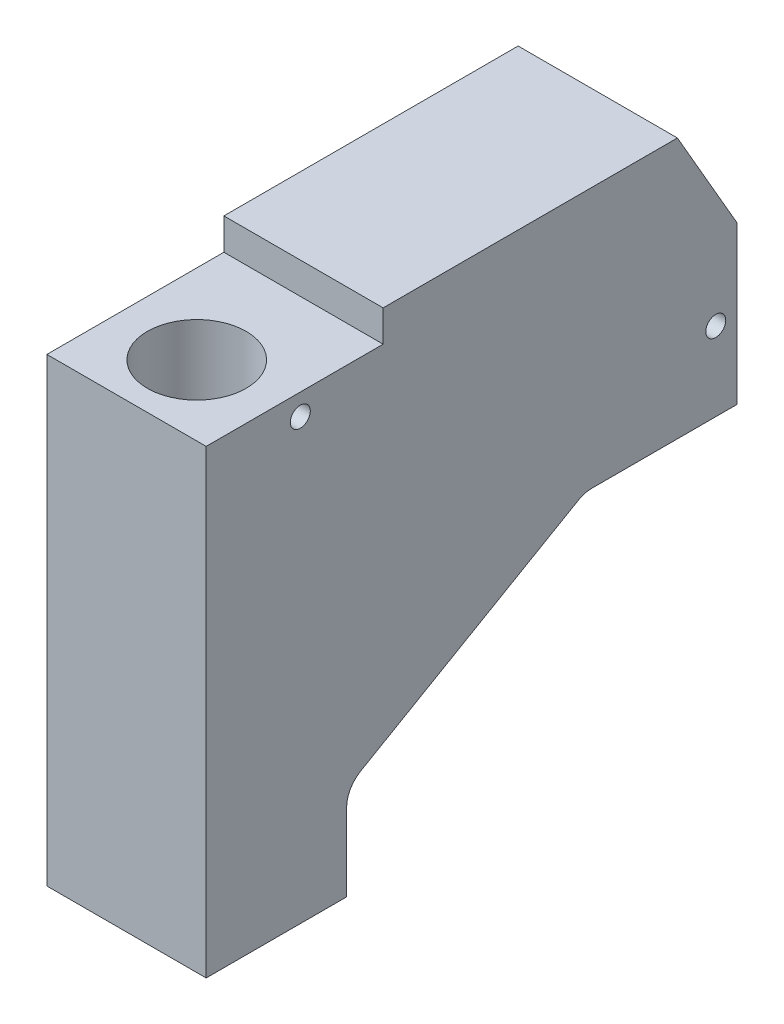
ISO-10303-21;
HEADER;
FILE_DESCRIPTION(('STEP AP214'),'2;1');
FILE_NAME('part.step','',(''),(''),'','','');
FILE_SCHEMA(('AUTOMOTIVE_DESIGN { 1 0 10303 214 1 1 1 1 }'));
ENDSEC;
DATA;
#1=APPLICATION_CONTEXT('core data for automotive mechanical design processes');
#2=APPLICATION_PROTOCOL_DEFINITION('international standard','automotive_design',2000,#1);
#3=PRODUCT_CONTEXT('',#1,'mechanical');
#4=PRODUCT('Part','Part','',(#3));
#5=PRODUCT_RELATED_PRODUCT_CATEGORY('part','',(#4));
#6=PRODUCT_DEFINITION_FORMATION('','',#4);
#7=PRODUCT_DEFINITION_CONTEXT('part definition',#1,'design');
#8=PRODUCT_DEFINITION('design','',#6,#7);
#9=PRODUCT_DEFINITION_SHAPE('','',#8);
#10=(LENGTH_UNIT() NAMED_UNIT(*) SI_UNIT(.MILLI.,.METRE.));
#11=(NAMED_UNIT(*) PLANE_ANGLE_UNIT() SI_UNIT($,.RADIAN.));
#12=(NAMED_UNIT(*) SI_UNIT($,.STERADIAN.) SOLID_ANGLE_UNIT());
#13=UNCERTAINTY_MEASURE_WITH_UNIT(LENGTH_MEASURE(1.E-05),#10,'distance_accuracy_value','');
#14=(GEOMETRIC_REPRESENTATION_CONTEXT(3) GLOBAL_UNCERTAINTY_ASSIGNED_CONTEXT((#13)) GLOBAL_UNIT_ASSIGNED_CONTEXT((#10,
#11,#12)) REPRESENTATION_CONTEXT('',''));
#15=CARTESIAN_POINT('',(0.,0.,0.));
#16=DIRECTION('',(0.,0.,1.));
#17=DIRECTION('',(1.,0.,0.));
#18=AXIS2_PLACEMENT_3D('',#15,#16,#17);
#19=CARTESIAN_POINT('',(0.,4.34443852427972,-16.));
#20=DIRECTION('',(0.,0.,1.));
#21=DIRECTION('',(0.,-1.,0.));
#22=AXIS2_PLACEMENT_3D('',#19,#20,#21);
#23=PLANE('',#22);
#24=CARTESIAN_POINT('',(0.,9.92568852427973,-16.));
#25=DIRECTION('',(0.,0.,1.));
#26=DIRECTION('',(0.,-1.,0.));
#27=AXIS2_PLACEMENT_3D('',#24,#25,#26);
#28=CIRCLE('',#27,5.58125);
#29=CARTESIAN_POINT('',(0.,4.34443852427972,-16.));
#30=VERTEX_POINT('',#29);
#31=EDGE_CURVE('E148',#30,#30,#28,.F.);
#32=ORIENTED_EDGE('',*,*,#31,.T.);
#33=EDGE_LOOP('',(#32));
#34=FACE_BOUND('',#33,.T.);
#35=CARTESIAN_POINT('',(0.,10.0221109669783,-16.));
#36=DIRECTION('',(0.,0.,1.));
#37=DIRECTION('',(0.,-1.,0.));
#38=AXIS2_PLACEMENT_3D('',#35,#36,#37);
#39=ELLIPSE('',#38,2.88675134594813,2.5);
#40=CARTESIAN_POINT('',(0.,7.13535962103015,-16.));
#41=VERTEX_POINT('',#40);
#42=EDGE_CURVE('E20',#41,#41,#39,.T.);
#43=ORIENTED_EDGE('',*,*,#42,.T.);
#44=EDGE_LOOP('',(#43));
#45=FACE_BOUND('',#44,.T.);
#46=ADVANCED_FACE('F17',(#34,#45),#23,.F.);
#47=CARTESIAN_POINT('',(0.,-13.3966593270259,22.0625));
#48=DIRECTION('',(0.,1.,0.));
#49=DIRECTION('',(0.,0.,1.));
#50=AXIS2_PLACEMENT_3D('',#47,#48,#49);
#51=CONICAL_SURFACE('',#50,2.50000000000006,1.04719755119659);
#52=CARTESIAN_POINT('',(0.,-13.3966593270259,22.0625));
#53=DIRECTION('',(0.,1.,0.));
#54=DIRECTION('',(0.,0.,1.));
#55=AXIS2_PLACEMENT_3D('',#52,#53,#54);
#56=CIRCLE('',#55,2.5);
#57=CARTESIAN_POINT('',(0.,-13.396659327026,19.5624999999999));
#58=VERTEX_POINT('',#57);
#59=EDGE_CURVE('E126',#58,#58,#56,.T.);
#60=ORIENTED_EDGE('',*,*,#59,.T.);
#61=EDGE_LOOP('',(#60));
#62=FACE_BOUND('',#61,.T.);
#63=CARTESIAN_POINT('',(0.,-14.6933880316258,22.0625));
#64=DIRECTION('',(0.,-1.,0.));
#65=DIRECTION('',(1.,0.,0.));
#66=AXIS2_PLACEMENT_3D('',#63,#64,#65);
#67=CIRCLE('',#66,0.254000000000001);
#68=CARTESIAN_POINT('',(0.254000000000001,-14.6933880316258,22.0625));
#69=VERTEX_POINT('',#68);
#70=EDGE_CURVE('E141',#69,#69,#67,.T.);
#71=ORIENTED_EDGE('',*,*,#70,.T.);
#72=EDGE_LOOP('',(#71));
#73=FACE_BOUND('',#72,.T.);
#74=ADVANCED_FACE('F128',(#62,#73),#51,.F.);
#75=CARTESIAN_POINT('',(0.,20.5273403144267,-34.1955909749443));
#76=DIRECTION('',(0.,-0.5,0.866025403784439));
#77=DIRECTION('',(0.,-0.866025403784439,-0.5));
#78=AXIS2_PLACEMENT_3D('',#75,#76,#77);
#79=CYLINDRICAL_SURFACE('',#78,2.5);
#80=CARTESIAN_POINT('',(0.,-11.9532836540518,22.0625));
#81=DIRECTION('',(0.,-0.866025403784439,0.5));
#82=DIRECTION('',(0.,0.5,0.866025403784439));
#83=AXIS2_PLACEMENT_3D('',#80,#81,#82);
#84=ELLIPSE('',#83,2.88675134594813,2.5);
#85=CARTESIAN_POINT('',(-2.5,-11.9532836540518,22.0625));
#86=VERTEX_POINT('',#85);
#87=EDGE_CURVE('E133',#86,#58,#84,.T.);
#88=ORIENTED_EDGE('',*,*,#87,.T.);
#89=CARTESIAN_POINT('',(0.,-11.9532836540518,22.0625));
#90=DIRECTION('',(0.,-0.866025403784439,0.5));
#91=DIRECTION('',(0.,0.5,0.866025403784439));
#92=AXIS2_PLACEMENT_3D('',#89,#90,#91);
#93=ELLIPSE('',#92,2.88675134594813,2.5);
#94=CARTESIAN_POINT('',(2.5,-11.9532836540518,22.0625));
#95=VERTEX_POINT('',#94);
#96=EDGE_CURVE('E137',#58,#95,#93,.T.);
#97=ORIENTED_EDGE('',*,*,#96,.T.);
#98=CARTESIAN_POINT('',(0.,-11.9532836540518,22.0625));
#99=DIRECTION('',(0.,0.5,0.866025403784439));
#100=DIRECTION('',(0.,-0.866025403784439,0.5));
#101=AXIS2_PLACEMENT_3D('',#98,#99,#100);
#102=ELLIPSE('',#101,5.,2.5);
#103=EDGE_CURVE('E132',#95,#86,#102,.T.);
#104=ORIENTED_EDGE('',*,*,#103,.T.);
#105=EDGE_LOOP('',(#88,#97,#104));
#106=FACE_BOUND('',#105,.T.);
#107=ORIENTED_EDGE('',*,*,#42,.F.);
#108=EDGE_LOOP('',(#107));
#109=FACE_BOUND('',#108,.T.);
#110=ADVANCED_FACE('F143',(#106,#109),#79,.F.);
#111=CARTESIAN_POINT('',(0.,9.92568852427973,-16.));
#112=DIRECTION('',(0.,0.,1.));
#113=DIRECTION('',(0.,-1.,0.));
#114=AXIS2_PLACEMENT_3D('',#111,#112,#113);
#115=CYLINDRICAL_SURFACE('',#114,5.58125);
#116=CARTESIAN_POINT('',(0.,9.92568852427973,-20.5000000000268));
#117=DIRECTION('',(0.,0.,-1.));
#118=DIRECTION('',(-1.,0.,0.));
#119=AXIS2_PLACEMENT_3D('',#116,#117,#118);
#120=CIRCLE('',#119,5.58125000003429);
#121=CARTESIAN_POINT('',(-5.58125000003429,9.92568852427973,-20.5000000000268));
#122=VERTEX_POINT('',#121);
#123=EDGE_CURVE('E276',#122,#122,#120,.T.);
#124=ORIENTED_EDGE('',*,*,#123,.T.);
#125=EDGE_LOOP('',(#124));
#126=FACE_BOUND('',#125,.T.);
#127=ORIENTED_EDGE('',*,*,#31,.F.);
#128=EDGE_LOOP('',(#127));
#129=FACE_BOUND('',#128,.T.);
#130=ADVANCED_FACE('F158',(#126,#129),#115,.F.);
#131=CARTESIAN_POINT('',(0.,27.792585,22.0625));
#132=DIRECTION('',(0.,-1.,0.));
#133=DIRECTION('',(1.,0.,0.));
#134=AXIS2_PLACEMENT_3D('',#131,#132,#133);
#135=CYLINDRICAL_SURFACE('',#134,0.254000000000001);
#136=ORIENTED_EDGE('',*,*,#70,.F.);
#137=EDGE_LOOP('',(#136));
#138=FACE_BOUND('',#137,.T.);
#139=CARTESIAN_POINT('',(0.,-25.791585,22.0625));
#140=DIRECTION('',(0.,-1.,0.));
#141=DIRECTION('',(1.,0.,0.));
#142=AXIS2_PLACEMENT_3D('',#139,#140,#141);
#143=CIRCLE('',#142,0.254000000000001);
#144=CARTESIAN_POINT('',(0.254000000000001,-25.791585,22.0625));
#145=VERTEX_POINT('',#144);
#146=EDGE_CURVE('E274',#145,#145,#143,.F.);
#147=ORIENTED_EDGE('',*,*,#146,.F.);
#148=EDGE_LOOP('',(#147));
#149=FACE_BOUND('',#148,.T.);
#150=ADVANCED_FACE('F165',(#138,#149),#135,.F.);
#151=CARTESIAN_POINT('',(0.,27.791585,22.0625));
#152=DIRECTION('',(0.,1.,0.));
#153=DIRECTION('',(0.,0.,1.));
#154=AXIS2_PLACEMENT_3D('',#151,#152,#153);
#155=CYLINDRICAL_SURFACE('',#154,2.5);
#156=CARTESIAN_POINT('',(0.,12.473585,22.0625));
#157=DIRECTION('',(0.,1.,0.));
#158=DIRECTION('',(0.,0.,1.));
#159=AXIS2_PLACEMENT_3D('',#156,#157,#158);
#160=CIRCLE('',#159,2.5);
#161=CARTESIAN_POINT('',(0.,12.473585,24.5625));
#162=VERTEX_POINT('',#161);
#163=EDGE_CURVE('E275',#162,#162,#160,.F.);
#164=ORIENTED_EDGE('',*,*,#163,.F.);
#165=EDGE_LOOP('',(#164));
#166=FACE_BOUND('',#165,.T.);
#167=ORIENTED_EDGE('',*,*,#103,.F.);
#168=ORIENTED_EDGE('',*,*,#96,.F.);
#169=ORIENTED_EDGE('',*,*,#59,.F.);
#170=ORIENTED_EDGE('',*,*,#87,.F.);
#171=EDGE_LOOP('',(#167,#168,#169,#170));
#172=FACE_BOUND('',#171,.T.);
#173=ADVANCED_FACE('F139',(#166,#172),#155,.F.);
#174=CARTESIAN_POINT('',(0.,9.92568852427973,-21.0087899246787));
#175=DIRECTION('',(0.,0.,-1.));
#176=DIRECTION('',(-1.,0.,0.));
#177=AXIS2_PLACEMENT_3D('',#174,#175,#176);
#178=CONICAL_SURFACE('',#177,5.87500000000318,0.523598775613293);
#179=ORIENTED_EDGE('',*,*,#123,.F.);
#180=EDGE_LOOP('',(#179));
#181=FACE_BOUND('',#180,.T.);
#182=CARTESIAN_POINT('',(0.,9.92568852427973,-21.0087899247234));
#183=DIRECTION('',(0.,0.,1.));
#184=DIRECTION('',(0.,-1.,0.));
#185=AXIS2_PLACEMENT_3D('',#182,#183,#184);
#186=CIRCLE('',#185,5.875);
#187=CARTESIAN_POINT('',(0.,15.8006885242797,-21.0087899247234));
#188=VERTEX_POINT('',#187);
#189=EDGE_CURVE('E313',#188,#188,#186,.F.);
#190=ORIENTED_EDGE('',*,*,#189,.T.);
#191=EDGE_LOOP('',(#190));
#192=FACE_BOUND('',#191,.T.);
#193=ADVANCED_FACE('F258',(#181,#192),#178,.F.);
#194=CARTESIAN_POINT('',(0.,-25.791585,22.0625));
#195=DIRECTION('',(0.,-1.,0.));
#196=DIRECTION('',(1.,0.,0.));
#197=AXIS2_PLACEMENT_3D('',#194,#195,#196);
#198=PLANE('',#197);
#199=ORIENTED_EDGE('',*,*,#146,.T.);
#200=EDGE_LOOP('',(#199));
#201=FACE_BOUND('',#200,.T.);
#202=CARTESIAN_POINT('',(0.,-25.791585,22.0625));
#203=DIRECTION('',(0.,-1.,0.));
#204=DIRECTION('',(1.,0.,0.));
#205=AXIS2_PLACEMENT_3D('',#202,#203,#204);
#206=CIRCLE('',#205,4.);
#207=CARTESIAN_POINT('',(4.,-25.791585,22.0625));
#208=VERTEX_POINT('',#207);
#209=EDGE_CURVE('E314',#208,#208,#206,.T.);
#210=ORIENTED_EDGE('',*,*,#209,.T.);
#211=EDGE_LOOP('',(#210));
#212=FACE_BOUND('',#211,.T.);
#213=ADVANCED_FACE('F254',(#201,#212),#198,.T.);
#214=CARTESIAN_POINT('',(0.,12.473585,22.0625));
#215=DIRECTION('',(0.,1.,0.));
#216=DIRECTION('',(-1.,0.,0.));
#217=AXIS2_PLACEMENT_3D('',#214,#215,#216);
#218=PLANE('',#217);
#219=CARTESIAN_POINT('',(0.,12.473585,22.0625));
#220=DIRECTION('',(0.,1.,0.));
#221=DIRECTION('',(-1.,0.,0.));
#222=AXIS2_PLACEMENT_3D('',#219,#220,#221);
#223=CIRCLE('',#222,5.58125);
#224=CARTESIAN_POINT('',(-5.58125,12.473585,22.0625));
#225=VERTEX_POINT('',#224);
#226=EDGE_CURVE('E239',#225,#225,#223,.T.);
#227=ORIENTED_EDGE('',*,*,#226,.T.);
#228=EDGE_LOOP('',(#227));
#229=FACE_BOUND('',#228,.T.);
#230=ORIENTED_EDGE('',*,*,#163,.T.);
#231=EDGE_LOOP('',(#230));
#232=FACE_BOUND('',#231,.T.);
#233=ADVANCED_FACE('F248',(#229,#232),#218,.T.);
#234=CARTESIAN_POINT('',(9.,21.822585,19.3625));
#235=DIRECTION('',(1.,0.,0.));
#236=DIRECTION('',(0.,1.,0.));
#237=AXIS2_PLACEMENT_3D('',#234,#235,#236);
#238=CYLINDRICAL_SURFACE('',#237,1.1303);
#239=CARTESIAN_POINT('',(5.35596802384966,21.8225850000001,20.4928));
#240=CARTESIAN_POINT('',(5.35596781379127,21.8837119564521,20.4927941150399));
#241=CARTESIAN_POINT('',(5.3545156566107,21.9449219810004,20.4878173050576));
#242=CARTESIAN_POINT('',(5.34866100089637,22.0656971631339,20.468047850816));
#243=CARTESIAN_POINT('',(5.34425139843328,22.1252579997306,20.4532315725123));
#244=CARTESIAN_POINT('',(5.33237926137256,22.2408704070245,20.4143209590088));
#245=CARTESIAN_POINT('',(5.32492056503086,22.29692628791,20.3902382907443));
#246=CARTESIAN_POINT('',(5.3068253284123,22.4040158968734,20.3336757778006));
#247=CARTESIAN_POINT('',(5.29619060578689,22.4550524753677,20.3012007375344));
#248=CARTESIAN_POINT('',(5.27153804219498,22.55119608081,20.2287307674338));
#249=CARTESIAN_POINT('',(5.25749430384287,22.5962534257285,20.1886788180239));
#250=CARTESIAN_POINT('',(5.22603654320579,22.6789187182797,20.1026561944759));
#251=CARTESIAN_POINT('',(5.20862190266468,22.7165252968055,20.0566844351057));
#252=CARTESIAN_POINT('',(5.16987454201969,22.7847153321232,19.9587875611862));
#253=CARTESIAN_POINT('',(5.14843089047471,22.8150240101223,19.9067154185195));
#254=CARTESIAN_POINT('',(5.10227933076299,22.8666227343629,19.7996483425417));
#255=CARTESIAN_POINT('',(5.07757057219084,22.887910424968,19.7446526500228));
#256=CARTESIAN_POINT('',(5.02336644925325,22.9227148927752,19.6292951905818));
#257=CARTESIAN_POINT('',(4.99365410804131,22.9355579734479,19.5688330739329));
#258=CARTESIAN_POINT('',(4.93148861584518,22.9512903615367,19.448041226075));
#259=CARTESIAN_POINT('',(4.89903442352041,22.9541758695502,19.3877115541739));
#260=CARTESIAN_POINT('',(4.82826998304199,22.9503432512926,19.2617963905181));
#261=CARTESIAN_POINT('',(4.78971195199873,22.9425062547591,19.1963847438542));
#262=CARTESIAN_POINT('',(4.71100462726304,22.9159993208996,19.0687696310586));
#263=CARTESIAN_POINT('',(4.67085410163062,22.8973208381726,19.0065687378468));
#264=CARTESIAN_POINT('',(4.58530085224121,22.8470052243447,18.8794351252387));
#265=CARTESIAN_POINT('',(4.53983632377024,22.8141012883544,18.8150430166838));
#266=CARTESIAN_POINT('',(4.45006412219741,22.7361976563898,18.6930773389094));
#267=CARTESIAN_POINT('',(4.40575640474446,22.6911984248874,18.6355035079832));
#268=CARTESIAN_POINT('',(4.32850955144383,22.5987804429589,18.5386578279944));
#269=CARTESIAN_POINT('',(4.29498081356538,22.5533385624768,18.4979688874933));
#270=CARTESIAN_POINT('',(4.23200473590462,22.4546673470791,18.4234261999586));
#271=CARTESIAN_POINT('',(4.20255127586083,22.4014499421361,18.3895621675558));
#272=CARTESIAN_POINT('',(4.15598793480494,22.3005674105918,18.3370390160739));
#273=CARTESIAN_POINT('',(4.1375939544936,22.2543875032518,18.3166733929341));
#274=CARTESIAN_POINT('',(4.10590767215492,22.1581857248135,18.2819671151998));
#275=CARTESIAN_POINT('',(4.09260615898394,22.1081709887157,18.2676155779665));
#276=CARTESIAN_POINT('',(4.07495518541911,22.0187950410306,18.2486813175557));
#277=CARTESIAN_POINT('',(4.06917751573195,21.9800438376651,18.2425290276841));
#278=CARTESIAN_POINT('',(4.06142439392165,21.9017291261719,18.2342869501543));
#279=CARTESIAN_POINT('',(4.05944892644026,21.862165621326,18.2321971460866));
#280=CARTESIAN_POINT('',(4.05945690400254,21.7702346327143,18.2322037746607));
#281=CARTESIAN_POINT('',(4.06292321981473,21.7178543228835,18.2358683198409));
#282=CARTESIAN_POINT('',(4.07639177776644,21.6149201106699,18.2502209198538));
#283=CARTESIAN_POINT('',(4.08640187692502,21.5643684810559,18.2609174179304));
#284=CARTESIAN_POINT('',(4.11183049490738,21.4668937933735,18.2884379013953));
#285=CARTESIAN_POINT('',(4.12720671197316,21.4199457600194,18.3052139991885));
#286=CARTESIAN_POINT('',(4.16219192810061,21.3299854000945,18.3440066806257));
#287=CARTESIAN_POINT('',(4.18180362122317,21.2869756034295,18.3660266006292));
#288=CARTESIAN_POINT('',(4.23305169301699,21.1880499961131,18.4246846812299));
#289=CARTESIAN_POINT('',(4.26627987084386,21.1342957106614,18.4635790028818));
#290=CARTESIAN_POINT('',(4.33651367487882,21.0356504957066,18.5485207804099));
#291=CARTESIAN_POINT('',(4.37352493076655,20.9907730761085,18.5945789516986));
#292=CARTESIAN_POINT('',(4.45016112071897,20.9092694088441,18.6934647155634));
#293=CARTESIAN_POINT('',(4.48982127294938,20.8728074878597,18.7463998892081));
#294=CARTESIAN_POINT('',(4.56966513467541,20.8094462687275,18.8573186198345));
#295=CARTESIAN_POINT('',(4.60984881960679,20.7825465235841,18.9153019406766));
#296=CARTESIAN_POINT('',(4.69608632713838,20.7351946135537,19.0451939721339));
#297=CARTESIAN_POINT('',(4.74202903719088,20.7165087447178,19.1178317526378));
#298=CARTESIAN_POINT('',(4.83142039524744,20.6938140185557,19.2669180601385));
#299=CARTESIAN_POINT('',(4.87486842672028,20.6898087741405,19.3433675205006));
#300=CARTESIAN_POINT('',(4.95627362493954,20.6975963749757,19.4948506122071));
#301=CARTESIAN_POINT('',(4.99437297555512,20.7088202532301,19.569834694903));
#302=CARTESIAN_POINT('',(5.06567048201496,20.7469695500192,19.7181277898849));
#303=CARTESIAN_POINT('',(5.09887409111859,20.7738773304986,19.7914385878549));
#304=CARTESIAN_POINT('',(5.15562412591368,20.8390495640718,19.9237130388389));
#305=CARTESIAN_POINT('',(5.17986250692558,20.8754219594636,19.983312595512));
#306=CARTESIAN_POINT('',(5.22360953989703,20.9595873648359,20.0958036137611));
#307=CARTESIAN_POINT('',(5.24312207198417,21.0073709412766,20.1487005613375));
#308=CARTESIAN_POINT('',(5.27549556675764,21.1072591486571,20.2399754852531));
#309=CARTESIAN_POINT('',(5.28884736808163,21.1583393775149,20.2793046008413));
#310=CARTESIAN_POINT('',(5.3118347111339,21.267084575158,20.3489904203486));
#311=CARTESIAN_POINT('',(5.32146936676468,21.3247511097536,20.3793449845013));
#312=CARTESIAN_POINT('',(5.33676925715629,21.4417957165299,20.4285241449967));
#313=CARTESIAN_POINT('',(5.34261059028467,21.5009397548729,20.4478541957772));
#314=CARTESIAN_POINT('',(5.35119373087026,21.6217064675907,20.4765278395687));
#315=CARTESIAN_POINT('',(5.35394349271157,21.6833223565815,20.4858970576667));
#316=CARTESIAN_POINT('',(5.35570931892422,21.7709773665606,20.4919186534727));
#317=CARTESIAN_POINT('',(5.35596811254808,21.7967737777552,20.4928024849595));
#318=CARTESIAN_POINT('',(5.35596802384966,21.8225850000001,20.4928));
#319=B_SPLINE_CURVE_WITH_KNOTS('',3,(#239,#240,#241,#242,#243,#244,#245,#246,#247,#248,#249,
#250,#251,#252,#253,#254,#255,#256,#257,#258,#259,#260,#261,#262,#263,#264,#265,#266,#267,#268,
#269,#270,#271,#272,#273,#274,#275,#276,#277,#278,#279,#280,#281,#282,#283,#284,#285,#286,#287,
#288,#289,#290,#291,#292,#293,#294,#295,#296,#297,#298,#299,#300,#301,#302,#303,#304,#305,#306,
#307,#308,#309,#310,#311,#312,#313,#314,#315,#316,#317,#318),.UNSPECIFIED.,.T.,.F.,(4,2,2,2,2,2,
2,2,2,2,2,2,2,2,2,2,2,2,2,2,2,2,2,2,2,2,2,2,2,2,2,2,2,2,2,2,2,2,2,4),(0.,0.183307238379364,
0.36705637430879,0.550574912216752,0.733988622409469,0.918841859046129,1.10372903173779,
1.29475755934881,1.48583593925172,1.69073954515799,1.8957213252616,2.12380237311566,
2.35206344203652,2.6071996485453,2.8623260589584,3.07039930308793,3.27815658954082,
3.43871562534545,3.59898285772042,3.71759179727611,3.83620025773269,3.9930749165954,
4.15013827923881,4.30599046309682,4.46194207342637,4.6833605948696,4.905113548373,
5.13088647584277,5.35664884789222,5.61921999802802,5.88185576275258,6.13494474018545,
6.38774964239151,6.60822951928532,6.82852775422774,7.02502805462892,7.22157516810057,
7.4081826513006,7.59430890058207,7.67171147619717),.UNSPECIFIED.);
#320=CARTESIAN_POINT('',(5.35596802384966,21.8225850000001,20.4928));
#321=VERTEX_POINT('',#320);
#322=EDGE_CURVE('E231',#321,#321,#319,.T.);
#323=ORIENTED_EDGE('',*,*,#322,.T.);
#324=EDGE_LOOP('',(#323));
#325=FACE_BOUND('',#324,.T.);
#326=CARTESIAN_POINT('',(9.,21.822585,19.3625));
#327=DIRECTION('',(1.,0.,0.));
#328=DIRECTION('',(0.,1.,0.));
#329=AXIS2_PLACEMENT_3D('',#326,#327,#328);
#330=CIRCLE('',#329,1.1303);
#331=CARTESIAN_POINT('',(9.,22.952885,19.3625));
#332=VERTEX_POINT('',#331);
#333=EDGE_CURVE('E238',#332,#332,#330,.T.);
#334=ORIENTED_EDGE('',*,*,#333,.T.);
#335=EDGE_LOOP('',(#334));
#336=FACE_BOUND('',#335,.T.);
#337=ADVANCED_FACE('F242',(#325,#336),#238,.F.);
#338=CARTESIAN_POINT('',(9.,7.22568852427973,-27.587));
#339=DIRECTION('',(1.,0.,0.));
#340=DIRECTION('',(0.,1.,0.));
#341=AXIS2_PLACEMENT_3D('',#338,#339,#340);
#342=CYLINDRICAL_SURFACE('',#341,1.1303);
#343=CARTESIAN_POINT('',(5.21781803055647,7.22568852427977,-26.4567));
#344=CARTESIAN_POINT('',(5.25114506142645,7.29009652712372,-26.4567017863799));
#345=CARTESIAN_POINT('',(5.28328780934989,7.35515780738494,-26.4622129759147));
#346=CARTESIAN_POINT('',(5.34442315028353,7.48480629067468,-26.4848356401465));
#347=CARTESIAN_POINT('',(5.37341448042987,7.54939329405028,-26.5019517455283));
#348=CARTESIAN_POINT('',(5.42771712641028,7.67618046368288,-26.5481528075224));
#349=CARTESIAN_POINT('',(5.45301246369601,7.73836945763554,-26.5772877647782));
#350=CARTESIAN_POINT('',(5.4993183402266,7.8575463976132,-26.6472653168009));
#351=CARTESIAN_POINT('',(5.52033103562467,7.91453695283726,-26.6881019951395));
#352=CARTESIAN_POINT('',(5.55636250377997,8.01646014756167,-26.7767846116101));
#353=CARTESIAN_POINT('',(5.57172822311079,8.06199480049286,-26.8237985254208));
#354=CARTESIAN_POINT('',(5.59869880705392,8.14465180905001,-26.9256520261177));
#355=CARTESIAN_POINT('',(5.61030488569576,8.18177687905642,-26.9804890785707));
#356=CARTESIAN_POINT('',(5.62930847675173,8.24416665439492,-27.0928681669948));
#357=CARTESIAN_POINT('',(5.63691420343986,8.27000270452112,-27.1500587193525));
#358=CARTESIAN_POINT('',(5.64905584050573,8.31191258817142,-27.2682170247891));
#359=CARTESIAN_POINT('',(5.65359222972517,8.32798794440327,-27.3291841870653));
#360=CARTESIAN_POINT('',(5.65964005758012,8.34954675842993,-27.4517047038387));
#361=CARTESIAN_POINT('',(5.66121639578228,8.35525736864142,-27.5132150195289));
#362=CARTESIAN_POINT('',(5.66158531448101,8.35658763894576,-27.6363520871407));
#363=CARTESIAN_POINT('',(5.66037803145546,8.35220779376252,-27.6979788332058));
#364=CARTESIAN_POINT('',(5.65516015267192,8.33355784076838,-27.8192704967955));
#365=CARTESIAN_POINT('',(5.6511638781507,8.31933826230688,-27.8789438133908));
#366=CARTESIAN_POINT('',(5.64028711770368,8.2815566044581,-27.9949744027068));
#367=CARTESIAN_POINT('',(5.63340668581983,8.25799470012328,-28.0513317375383));
#368=CARTESIAN_POINT('',(5.6166039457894,8.2022526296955,-28.1593710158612));
#369=CARTESIAN_POINT('',(5.60667086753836,8.17004200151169,-28.211035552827));
#370=CARTESIAN_POINT('',(5.5836603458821,8.09818177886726,-28.3080965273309));
#371=CARTESIAN_POINT('',(5.57058303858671,8.05853250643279,-28.3534932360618));
#372=CARTESIAN_POINT('',(5.54098869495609,7.97244220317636,-28.4376600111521));
#373=CARTESIAN_POINT('',(5.52441687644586,7.92589701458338,-28.476304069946));
#374=CARTESIAN_POINT('',(5.48803548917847,7.82811589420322,-28.545248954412));
#375=CARTESIAN_POINT('',(5.46822441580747,7.77687778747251,-28.5755458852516));
#376=CARTESIAN_POINT('',(5.42459560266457,7.66893702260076,-28.6285805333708));
#377=CARTESIAN_POINT('',(5.40063601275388,7.61209160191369,-28.6509089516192));
#378=CARTESIAN_POINT('',(5.34979579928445,7.4968476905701,-28.6859420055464));
#379=CARTESIAN_POINT('',(5.32291836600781,7.43845094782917,-28.698657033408));
#380=CARTESIAN_POINT('',(5.28244616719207,7.35426638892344,-28.7102654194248));
#381=CARTESIAN_POINT('',(5.26981427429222,7.32847700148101,-28.7129121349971));
#382=CARTESIAN_POINT('',(5.24412674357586,7.27699266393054,-28.7164299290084));
#383=CARTESIAN_POINT('',(5.23107112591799,7.25129770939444,-28.7173010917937));
#384=CARTESIAN_POINT('',(5.17348625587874,7.14002547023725,-28.7172963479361));
#385=CARTESIAN_POINT('',(5.12694488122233,7.05532209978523,-28.7075329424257));
#386=CARTESIAN_POINT('',(5.03153643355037,6.89116225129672,-28.6699633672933));
#387=CARTESIAN_POINT('',(4.98266159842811,6.81172573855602,-28.6420924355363));
#388=CARTESIAN_POINT('',(4.89226327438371,6.67187874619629,-28.5749149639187));
#389=CARTESIAN_POINT('',(4.85071134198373,6.61038557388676,-28.5378806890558));
#390=CARTESIAN_POINT('',(4.76961787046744,6.49475059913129,-28.4521446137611));
#391=CARTESIAN_POINT('',(4.73007256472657,6.4405946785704,-28.4034657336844));
#392=CARTESIAN_POINT('',(4.66323451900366,6.35185560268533,-28.3062799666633));
#393=CARTESIAN_POINT('',(4.63511758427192,6.31555403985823,-28.2599063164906));
#394=CARTESIAN_POINT('',(4.58314635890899,6.24980146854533,-28.1603822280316));
#395=CARTESIAN_POINT('',(4.55928669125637,6.22034180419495,-28.1072404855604));
#396=CARTESIAN_POINT('',(4.52158182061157,6.17447025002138,-28.0053671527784));
#397=CARTESIAN_POINT('',(4.50669908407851,6.15665012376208,-27.9576577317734));
#398=CARTESIAN_POINT('',(4.48208614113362,6.12741299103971,-27.8590417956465));
#399=CARTESIAN_POINT('',(4.47235176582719,6.11599080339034,-27.8081379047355));
#400=CARTESIAN_POINT('',(4.45888897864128,6.1002412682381,-27.7041509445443));
#401=CARTESIAN_POINT('',(4.455193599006,6.09595293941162,-27.6510575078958));
#402=CARTESIAN_POINT('',(4.45431359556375,6.09492924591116,-27.5447446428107));
#403=CARTESIAN_POINT('',(4.45712801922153,6.09819277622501,-27.491525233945));
#404=CARTESIAN_POINT('',(4.46843768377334,6.11140577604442,-27.3913364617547));
#405=CARTESIAN_POINT('',(4.47641919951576,6.12075099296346,-27.3442252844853));
#406=CARTESIAN_POINT('',(4.4968997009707,6.14497856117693,-27.2524902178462));
#407=CARTESIAN_POINT('',(4.50940004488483,6.15986257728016,-27.2078670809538));
#408=CARTESIAN_POINT('',(4.53927241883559,6.19591379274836,-27.1183211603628));
#409=CARTESIAN_POINT('',(4.55695934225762,6.2174954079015,-27.0736725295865));
#410=CARTESIAN_POINT('',(4.59561969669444,6.26551703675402,-26.988638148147));
#411=CARTESIAN_POINT('',(4.61659468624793,6.29195935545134,-26.9482544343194));
#412=CARTESIAN_POINT('',(4.66555770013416,6.35496058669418,-26.8640018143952));
#413=CARTESIAN_POINT('',(4.69409498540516,6.39247870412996,-26.8211704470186));
#414=CARTESIAN_POINT('',(4.75333597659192,6.47258685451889,-26.7422618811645));
#415=CARTESIAN_POINT('',(4.78404183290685,6.51518195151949,-26.7061915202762));
#416=CARTESIAN_POINT('',(4.85324951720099,6.61419778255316,-26.6340214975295));
#417=CARTESIAN_POINT('',(4.89201714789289,6.6716295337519,-26.5995568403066));
#418=CARTESIAN_POINT('',(4.96968812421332,6.79153421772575,-26.5412813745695));
#419=CARTESIAN_POINT('',(5.00859139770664,6.85400477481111,-26.5174655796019));
#420=CARTESIAN_POINT('',(5.07638998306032,6.96778283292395,-26.4853201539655));
#421=CARTESIAN_POINT('',(5.10551083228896,7.0183124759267,-26.4746782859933));
#422=CARTESIAN_POINT('',(5.16262342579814,7.12097923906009,-26.4603676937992));
#423=CARTESIAN_POINT('',(5.19061523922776,7.17311626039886,-26.4566985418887));
#424=CARTESIAN_POINT('',(5.21781803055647,7.22568852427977,-26.4567));
#425=B_SPLINE_CURVE_WITH_KNOTS('',3,(#343,#344,#345,#346,#347,#348,#349,#350,#351,#352,#353,
#354,#355,#356,#357,#358,#359,#360,#361,#362,#363,#364,#365,#366,#367,#368,#369,#370,#371,#372,
#373,#374,#375,#376,#377,#378,#379,#380,#381,#382,#383,#384,#385,#386,#387,#388,#389,#390,#391,
#392,#393,#394,#395,#396,#397,#398,#399,#400,#401,#402,#403,#404,#405,#406,#407,#408,#409,#410,
#411,#412,#413,#414,#415,#416,#417,#418,#419,#420,#421,#422,#423,#424),.UNSPECIFIED.,.T.,.F.,(4,
2,2,2,2,2,2,2,2,2,2,2,2,2,2,2,2,2,2,2,2,2,2,2,2,2,2,2,2,2,2,2,2,2,2,2,2,2,2,2,4),(0.,
0.217370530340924,0.434827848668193,0.653199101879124,0.87146014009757,1.0721006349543,
1.27267627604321,1.4613960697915,1.65008641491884,1.83458907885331,2.0190826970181,
2.20263586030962,2.3861855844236,2.57039047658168,2.75458739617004,2.94192096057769,
3.12934178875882,3.32533805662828,3.52112214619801,3.60758921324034,3.69405217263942,
3.98327188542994,4.27353173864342,4.52128665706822,4.76855786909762,4.96362700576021,
5.1584479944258,5.31698201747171,5.47538747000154,5.63465650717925,5.79390224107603,
5.93934027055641,6.08482205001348,6.24220589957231,6.39966457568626,6.59005494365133,
6.78063683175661,7.01187188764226,7.24299855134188,7.42043553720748,7.59786163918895),.UNSPECIFIED.);
#426=CARTESIAN_POINT('',(5.21781803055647,7.22568852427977,-26.4567));
#427=VERTEX_POINT('',#426);
#428=EDGE_CURVE('E293',#427,#427,#425,.T.);
#429=ORIENTED_EDGE('',*,*,#428,.T.);
#430=EDGE_LOOP('',(#429));
#431=FACE_BOUND('',#430,.T.);
#432=CARTESIAN_POINT('',(9.,7.22568852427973,-27.587));
#433=DIRECTION('',(1.,0.,0.));
#434=DIRECTION('',(0.,1.,0.));
#435=AXIS2_PLACEMENT_3D('',#432,#433,#434);
#436=CIRCLE('',#435,1.1303);
#437=CARTESIAN_POINT('',(9.,8.35598852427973,-27.587));
#438=VERTEX_POINT('',#437);
#439=EDGE_CURVE('E357',#438,#438,#436,.T.);
#440=ORIENTED_EDGE('',*,*,#439,.T.);
#441=EDGE_LOOP('',(#440));
#442=FACE_BOUND('',#441,.T.);
#443=ADVANCED_FACE('F247',(#431,#442),#342,.F.);
#444=CARTESIAN_POINT('',(0.,20.5273403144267,-34.1955909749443));
#445=DIRECTION('',(0.,-0.5,0.866025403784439));
#446=DIRECTION('',(0.,-0.866025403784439,-0.5));
#447=AXIS2_PLACEMENT_3D('',#444,#445,#446);
#448=CYLINDRICAL_SURFACE('',#447,2.5);
#449=CARTESIAN_POINT('',(1.31685485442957,15.6512031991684,-30.));
#450=CARTESIAN_POINT('',(1.36256945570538,15.6406767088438,-29.9250504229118));
#451=CARTESIAN_POINT('',(1.40607079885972,15.6301070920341,-29.8488043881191));
#452=CARTESIAN_POINT('',(1.48914619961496,15.6089922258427,-29.6942592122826));
#453=CARTESIAN_POINT('',(1.52872287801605,15.5984469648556,-29.615961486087));
#454=CARTESIAN_POINT('',(1.60441955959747,15.5775015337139,-29.4579357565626));
#455=CARTESIAN_POINT('',(1.6405474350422,15.567101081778,-29.378211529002));
#456=CARTESIAN_POINT('',(1.70982418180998,15.5464920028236,-29.2174418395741));
#457=CARTESIAN_POINT('',(1.74297245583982,15.5362834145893,-29.1363961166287));
#458=CARTESIAN_POINT('',(1.83885682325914,15.5059008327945,-28.8904891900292));
#459=CARTESIAN_POINT('',(1.89750784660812,15.486119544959,-28.7239789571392));
#460=CARTESIAN_POINT('',(2.00568194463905,15.448019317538,-28.3877454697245));
#461=CARTESIAN_POINT('',(2.0551972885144,15.4297016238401,-28.2180196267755));
#462=CARTESIAN_POINT('',(2.14149681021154,15.3966598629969,-27.8933064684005));
#463=CARTESIAN_POINT('',(2.17905895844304,15.3817596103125,-27.7385426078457));
#464=CARTESIAN_POINT('',(2.2479704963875,15.3537301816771,-27.4274633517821));
#465=CARTESIAN_POINT('',(2.2793191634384,15.3406012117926,-27.2711477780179));
#466=CARTESIAN_POINT('',(2.33600363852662,15.3163899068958,-26.957158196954));
#467=CARTESIAN_POINT('',(2.36133516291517,15.3053090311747,-26.799483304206));
#468=CARTESIAN_POINT('',(2.40593679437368,15.285510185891,-26.4831317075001));
#469=CARTESIAN_POINT('',(2.42520702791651,15.2767921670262,-26.3244550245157));
#470=CARTESIAN_POINT('',(2.45742001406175,15.2620753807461,-26.0068268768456));
#471=CARTESIAN_POINT('',(2.47038215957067,15.256068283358,-25.8478777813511));
#472=CARTESIAN_POINT('',(2.48964733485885,15.2470976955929,-25.5294597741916));
#473=CARTESIAN_POINT('',(2.49594950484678,15.2441345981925,-25.369990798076));
#474=CARTESIAN_POINT('',(2.50123045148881,15.2416532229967,-25.0511442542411));
#475=CARTESIAN_POINT('',(2.50022071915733,15.2421295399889,-24.8917669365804));
#476=CARTESIAN_POINT('',(2.4899768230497,15.2469365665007,-24.5733632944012));
#477=CARTESIAN_POINT('',(2.48074593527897,15.2512657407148,-24.4143368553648));
#478=CARTESIAN_POINT('',(2.45829225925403,15.2616518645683,-24.1597003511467));
#479=CARTESIAN_POINT('',(2.44807078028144,15.2663580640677,-24.0637663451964));
#480=CARTESIAN_POINT('',(2.42377745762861,15.277427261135,-23.8724822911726));
#481=CARTESIAN_POINT('',(2.40970583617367,15.283790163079,-23.7771322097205));
#482=CARTESIAN_POINT('',(2.37730221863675,15.2982464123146,-23.5873013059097));
#483=CARTESIAN_POINT('',(2.35897135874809,15.3063392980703,-23.492820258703));
#484=CARTESIAN_POINT('',(2.31757904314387,15.3242945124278,-23.3050916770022));
#485=CARTESIAN_POINT('',(2.29451752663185,15.33415686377,-23.2118441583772));
#486=CARTESIAN_POINT('',(2.21695007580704,15.3666482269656,-22.9328623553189));
#487=CARTESIAN_POINT('',(2.15431505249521,15.3920615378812,-22.7494988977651));
#488=CARTESIAN_POINT('',(2.0406449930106,15.4350419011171,-22.4838347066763));
#489=CARTESIAN_POINT('',(1.99947809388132,15.4501755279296,-22.3968585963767));
#490=CARTESIAN_POINT('',(1.90993166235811,15.4817707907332,-22.2269681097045));
#491=CARTESIAN_POINT('',(1.86155512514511,15.4982318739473,-22.1440520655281));
#492=CARTESIAN_POINT('',(1.73620089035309,15.5388120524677,-21.951418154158));
#493=CARTESIAN_POINT('',(1.65550190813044,15.5633721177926,-21.8441631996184));
#494=CARTESIAN_POINT('',(1.47796426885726,15.6124868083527,-21.6437370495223));
#495=CARTESIAN_POINT('',(1.38113459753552,15.6370414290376,-21.5505580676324));
#496=CARTESIAN_POINT('',(1.22377115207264,15.6720737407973,-21.4242891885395));
#497=CARTESIAN_POINT('',(1.16893914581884,15.6835128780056,-21.3842553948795));
#498=CARTESIAN_POINT('',(1.05559229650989,15.7053664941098,-21.3094963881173));
#499=CARTESIAN_POINT('',(0.997079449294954,15.715781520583,-21.2747683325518));
#500=CARTESIAN_POINT('',(0.876798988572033,15.7352110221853,-21.2111827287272));
#501=CARTESIAN_POINT('',(0.815035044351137,15.744227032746,-21.1823187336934));
#502=CARTESIAN_POINT('',(0.688754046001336,15.7605237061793,-21.1308939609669));
#503=CARTESIAN_POINT('',(0.624238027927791,15.7678050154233,-21.1083308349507));
#504=CARTESIAN_POINT('',(0.468412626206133,15.7826832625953,-21.0626780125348));
#505=CARTESIAN_POINT('',(0.376113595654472,15.7893781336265,-21.0425526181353));
#506=CARTESIAN_POINT('',(0.236045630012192,15.7961328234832,-21.0223405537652));
#507=CARTESIAN_POINT('',(0.189014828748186,15.7978365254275,-21.0172657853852));
#508=CARTESIAN_POINT('',(0.0946632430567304,15.8001156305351,-21.010489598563));
#509=CARTESIAN_POINT('',(0.0473423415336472,15.8006905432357,-21.0087896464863));
#510=CARTESIAN_POINT('',(0.,15.8006885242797,-21.0087899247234));
#511=B_SPLINE_CURVE_WITH_KNOTS('',3,(#449,#450,#451,#452,#453,#454,#455,#456,#457,#458,#459,
#460,#461,#462,#463,#464,#465,#466,#467,#468,#469,#470,#471,#472,#473,#474,#475,#476,#477,#478,
#479,#480,#481,#482,#483,#484,#485,#486,#487,#488,#489,#490,#491,#492,#493,#494,#495,#496,#497,
#498,#499,#500,#501,#502,#503,#504,#505,#506,#507,#508,#509,#510),.UNSPECIFIED.,.F.,.F.,(4,2,2,
2,2,2,2,2,2,2,2,2,2,2,2,2,2,2,2,2,2,2,2,2,2,2,2,2,2,2,4),(0.,0.265163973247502,
0.530149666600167,0.794515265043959,1.05893374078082,1.59150202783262,2.12451893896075,
2.60423279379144,3.08400240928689,3.5641125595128,4.04421269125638,4.52282738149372,
5.00150385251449,5.47942822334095,5.95716223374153,6.24685847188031,6.53653799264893,
6.82614032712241,7.11574638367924,7.69983704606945,7.99177510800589,8.2835922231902,
8.69152131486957,9.09922392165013,9.30550760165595,9.51168037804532,9.71762525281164,
9.92349326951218,10.2064213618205,10.3483105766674,10.4902614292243),.UNSPECIFIED.);
#512=CARTESIAN_POINT('',(1.31685485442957,15.6512031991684,-30.));
#513=VERTEX_POINT('',#512);
#514=EDGE_CURVE('E286',#513,#188,#511,.T.);
#515=ORIENTED_EDGE('',*,*,#514,.T.);
#516=CARTESIAN_POINT('',(0.,15.8006885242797,-21.0087899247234));
#517=CARTESIAN_POINT('',(-0.0562016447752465,15.8006966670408,-21.0087802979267));
#518=CARTESIAN_POINT('',(-0.112397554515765,15.7998822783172,-21.0111831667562));
#519=CARTESIAN_POINT('',(-0.224318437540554,15.7966691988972,-21.0207398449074));
#520=CARTESIAN_POINT('',(-0.280043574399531,15.7942710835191,-21.0278919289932));
#521=CARTESIAN_POINT('',(-0.390323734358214,15.7879673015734,-21.0468248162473));
#522=CARTESIAN_POINT('',(-0.444883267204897,15.7840693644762,-21.0585818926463));
#523=CARTESIAN_POINT('',(-0.552707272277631,15.7748827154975,-21.0865743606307));
#524=CARTESIAN_POINT('',(-0.605971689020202,15.7695939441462,-21.1028099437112));
#525=CARTESIAN_POINT('',(-0.763155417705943,15.7518609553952,-21.1579435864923));
#526=CARTESIAN_POINT('',(-0.864672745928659,15.7375373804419,-21.2033048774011));
#527=CARTESIAN_POINT('',(-1.05874945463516,15.7053428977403,-21.3092690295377));
#528=CARTESIAN_POINT('',(-1.15130131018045,15.6874690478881,-21.369884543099));
#529=CARTESIAN_POINT('',(-1.33008593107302,15.648908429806,-21.5070578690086));
#530=CARTESIAN_POINT('',(-1.41583102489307,15.6281299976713,-21.5842215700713));
#531=CARTESIAN_POINT('',(-1.57548019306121,15.5861057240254,-21.7498060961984));
#532=CARTESIAN_POINT('',(-1.6493781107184,15.5648596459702,-21.8382327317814));
#533=CARTESIAN_POINT('',(-1.77197623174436,15.5273820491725,-22.0051239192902));
#534=CARTESIAN_POINT('',(-1.82276072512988,15.5109969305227,-22.0820476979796));
#535=CARTESIAN_POINT('',(-1.91736329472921,15.4792298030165,-22.2402810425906));
#536=CARTESIAN_POINT('',(-1.96117792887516,15.46384829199,-22.3215927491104));
#537=CARTESIAN_POINT('',(-2.08303600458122,15.4197007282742,-22.5708415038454));
#538=CARTESIAN_POINT('',(-2.1513778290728,15.3929693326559,-22.7439273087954));
#539=CARTESIAN_POINT('',(-2.2561838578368,15.3504259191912,-23.0657664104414));
#540=CARTESIAN_POINT('',(-2.29617062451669,15.3335147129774,-23.2132974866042));
#541=CARTESIAN_POINT('',(-2.36403627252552,15.3041949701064,-23.5116429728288));
#542=CARTESIAN_POINT('',(-2.39190681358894,15.2917895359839,-23.6624595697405));
#543=CARTESIAN_POINT('',(-2.43743748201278,15.2712602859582,-23.9663691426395));
#544=CARTESIAN_POINT('',(-2.45506359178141,15.2631507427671,-24.1194679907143));
#545=CARTESIAN_POINT('',(-2.48147154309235,15.2509239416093,-24.4266161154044));
#546=CARTESIAN_POINT('',(-2.490250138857,15.2468081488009,-24.5806657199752));
#547=CARTESIAN_POINT('',(-2.49975912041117,15.2423463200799,-24.8785478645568));
#548=CARTESIAN_POINT('',(-2.50099656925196,15.2417627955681,-25.022362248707));
#549=CARTESIAN_POINT('',(-2.49746559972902,15.2434224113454,-25.3099161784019));
#550=CARTESIAN_POINT('',(-2.49269618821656,15.2456660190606,-25.4536557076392));
#551=CARTESIAN_POINT('',(-2.47765234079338,15.2526887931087,-25.7408810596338));
#552=CARTESIAN_POINT('',(-2.46737393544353,15.2574697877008,-25.8843666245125));
#553=CARTESIAN_POINT('',(-2.44165761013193,15.2692952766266,-26.1707822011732));
#554=CARTESIAN_POINT('',(-2.42621949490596,15.2763398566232,-26.3137121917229));
#555=CARTESIAN_POINT('',(-2.39042896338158,15.2924248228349,-26.5985358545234));
#556=CARTESIAN_POINT('',(-2.37008688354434,15.3014610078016,-26.7404310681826));
#557=CARTESIAN_POINT('',(-2.32454972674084,15.3213081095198,-27.0233052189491));
#558=CARTESIAN_POINT('',(-2.29935497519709,15.3321189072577,-27.1642842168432));
#559=CARTESIAN_POINT('',(-2.24406771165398,15.3553003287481,-27.4451085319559));
#560=CARTESIAN_POINT('',(-2.21397660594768,15.3676705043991,-27.5849541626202));
#561=CARTESIAN_POINT('',(-2.14870334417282,15.3937717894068,-27.8633144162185));
#562=CARTESIAN_POINT('',(-2.11352159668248,15.4075027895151,-28.0018291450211));
#563=CARTESIAN_POINT('',(-2.03096359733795,15.4386819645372,-28.3017844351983));
#564=CARTESIAN_POINT('',(-1.98253147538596,15.4563565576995,-28.4629129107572));
#565=CARTESIAN_POINT('',(-1.87722070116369,15.4929848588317,-28.782135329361));
#566=CARTESIAN_POINT('',(-1.82034883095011,15.5119375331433,-28.9402315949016));
#567=CARTESIAN_POINT('',(-1.72757319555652,15.5410385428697,-29.1742379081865));
#568=CARTESIAN_POINT('',(-1.69541907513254,15.5508464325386,-29.2516837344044));
#569=CARTESIAN_POINT('',(-1.62833726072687,15.5706301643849,-29.4053317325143));
#570=CARTESIAN_POINT('',(-1.59341007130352,15.58060597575,-29.4815341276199));
#571=CARTESIAN_POINT('',(-1.52036511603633,15.6006829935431,-29.6326005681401));
#572=CARTESIAN_POINT('',(-1.48224045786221,15.6107844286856,-29.7074612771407));
#573=CARTESIAN_POINT('',(-1.40237458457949,15.6310050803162,-29.8552799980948));
#574=CARTESIAN_POINT('',(-1.36063116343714,15.6411243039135,-29.9282368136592));
#575=CARTESIAN_POINT('',(-1.31685485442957,15.6512031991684,-30.));
#576=B_SPLINE_CURVE_WITH_KNOTS('',3,(#516,#517,#518,#519,#520,#521,#522,#523,#524,#525,#526,
#527,#528,#529,#530,#531,#532,#533,#534,#535,#536,#537,#538,#539,#540,#541,#542,#543,#544,#545,
#546,#547,#548,#549,#550,#551,#552,#553,#554,#555,#556,#557,#558,#559,#560,#561,#562,#563,#564,
#565,#566,#567,#568,#569,#570,#571,#572,#573,#574,#575),.UNSPECIFIED.,.F.,.F.,(4,2,2,2,2,2,2,2,
2,2,2,2,2,2,2,2,2,2,2,2,2,2,2,2,2,2,2,2,2,4),(0.,0.16853813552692,0.337015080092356,
0.504635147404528,0.672262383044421,1.00689200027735,1.34180008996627,1.69213998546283,
2.04266135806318,2.32313194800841,2.60374062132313,3.16556534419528,3.62634907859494,
4.08744949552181,4.55007241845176,5.01286499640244,5.44416222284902,5.87553076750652,
6.30721054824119,6.73890666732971,7.16970070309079,7.60046585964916,8.03110751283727,
8.46171462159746,8.96903801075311,9.47595590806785,9.72919292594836,9.98238397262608,
10.2361355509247,10.4900429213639),.UNSPECIFIED.);
#577=CARTESIAN_POINT('',(-1.31685485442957,15.6512031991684,-30.));
#578=VERTEX_POINT('',#577);
#579=EDGE_CURVE('E306',#188,#578,#576,.T.);
#580=ORIENTED_EDGE('',*,*,#579,.T.);
#581=CARTESIAN_POINT('',(0.,18.105014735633,-30.));
#582=DIRECTION('',(0.,0.,1.));
#583=DIRECTION('',(0.,-1.,0.));
#584=AXIS2_PLACEMENT_3D('',#581,#582,#583);
#585=ELLIPSE('',#584,2.88675134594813,2.5);
#586=CARTESIAN_POINT('',(-1.802775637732,16.105014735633,-30.));
#587=VERTEX_POINT('',#586);
#588=EDGE_CURVE('E278',#587,#578,#585,.T.);
#589=ORIENTED_EDGE('',*,*,#588,.F.);
#590=CARTESIAN_POINT('',(0.,17.605014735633,-29.1339745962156));
#591=DIRECTION('',(0.,-0.5,0.866025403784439));
#592=DIRECTION('',(0.,-0.866025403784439,-0.5));
#593=AXIS2_PLACEMENT_3D('',#590,#591,#592);
#594=CIRCLE('',#593,2.5);
#595=CARTESIAN_POINT('',(1.802775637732,16.105014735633,-30.));
#596=VERTEX_POINT('',#595);
#597=EDGE_CURVE('E352',#587,#596,#594,.F.);
#598=ORIENTED_EDGE('',*,*,#597,.T.);
#599=CARTESIAN_POINT('',(0.,18.105014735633,-30.));
#600=DIRECTION('',(0.,0.,1.));
#601=DIRECTION('',(0.,-1.,0.));
#602=AXIS2_PLACEMENT_3D('',#599,#600,#601);
#603=ELLIPSE('',#602,2.88675134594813,2.5);
#604=EDGE_CURVE('E284',#513,#596,#603,.T.);
#605=ORIENTED_EDGE('',*,*,#604,.F.);
#606=EDGE_LOOP('',(#515,#580,#589,#598,#605));
#607=FACE_BOUND('',#606,.T.);
#608=ADVANCED_FACE('F297',(#607),#448,.F.);
#609=CARTESIAN_POINT('',(0.,9.92568852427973,-16.));
#610=DIRECTION('',(0.,0.,1.));
#611=DIRECTION('',(0.,-1.,0.));
#612=AXIS2_PLACEMENT_3D('',#609,#610,#611);
#613=CYLINDRICAL_SURFACE('',#612,5.875);
#614=CARTESIAN_POINT('',(0.,9.92568852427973,-30.));
#615=DIRECTION('',(0.,0.,1.));
#616=DIRECTION('',(0.,-1.,0.));
#617=AXIS2_PLACEMENT_3D('',#614,#615,#616);
#618=CIRCLE('',#617,5.875);
#619=EDGE_CURVE('E347',#513,#578,#618,.F.);
#620=ORIENTED_EDGE('',*,*,#619,.T.);
#621=ORIENTED_EDGE('',*,*,#579,.F.);
#622=ORIENTED_EDGE('',*,*,#189,.F.);
#623=ORIENTED_EDGE('',*,*,#514,.F.);
#624=EDGE_LOOP('',(#620,#621,#622,#623));
#625=FACE_BOUND('',#624,.T.);
#626=ORIENTED_EDGE('',*,*,#428,.F.);
#627=EDGE_LOOP('',(#626));
#628=FACE_BOUND('',#627,.T.);
#629=ADVANCED_FACE('F299',(#625,#628),#613,.F.);
#630=CARTESIAN_POINT('',(-60.2845722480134,-4.85556147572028,-13.6311154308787));
#631=DIRECTION('',(-1.,0.,0.));
#632=DIRECTION('',(0.,-1.,0.));
#633=AXIS2_PLACEMENT_3D('',#630,#631,#632);
#634=CYLINDRICAL_SURFACE('',#633,3.2);
#635=DIRECTION('',(-1.,0.,0.));
#636=VECTOR('',#635,1.);
#637=CARTESIAN_POINT('',(-60.2845722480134,-1.65556147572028,-13.6311154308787));
#638=LINE('',#637,#636);
#639=CARTESIAN_POINT('',(-9.,-1.65556147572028,-13.6311154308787));
#640=VERTEX_POINT('',#639);
#641=CARTESIAN_POINT('',(9.,-1.65556147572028,-13.6311154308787));
#642=VERTEX_POINT('',#641);
#643=EDGE_CURVE('E394',#640,#642,#638,.F.);
#644=ORIENTED_EDGE('',*,*,#643,.T.);
#645=CARTESIAN_POINT('',(9.,-4.85556147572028,-13.6311154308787));
#646=DIRECTION('',(-1.,0.,0.));
#647=DIRECTION('',(0.,-1.,0.));
#648=AXIS2_PLACEMENT_3D('',#645,#646,#647);
#649=CIRCLE('',#648,3.2);
#650=CARTESIAN_POINT('',(9.,-2.08428018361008,-12.0311154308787));
#651=VERTEX_POINT('',#650);
#652=EDGE_CURVE('E356',#642,#651,#649,.F.);
#653=ORIENTED_EDGE('',*,*,#652,.T.);
#654=DIRECTION('',(1.,0.,0.));
#655=VECTOR('',#654,1.);
#656=CARTESIAN_POINT('',(-60.2845722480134,-2.08428018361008,-12.0311154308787));
#657=LINE('',#656,#655);
#658=CARTESIAN_POINT('',(-9.,-2.08428018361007,-12.0311154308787));
#659=VERTEX_POINT('',#658);
#660=EDGE_CURVE('E346',#651,#659,#657,.F.);
#661=ORIENTED_EDGE('',*,*,#660,.T.);
#662=CARTESIAN_POINT('',(-9.,-4.85556147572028,-13.6311154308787));
#663=DIRECTION('',(-1.,0.,0.));
#664=DIRECTION('',(0.,-1.,0.));
#665=AXIS2_PLACEMENT_3D('',#662,#663,#664);
#666=CIRCLE('',#665,3.2);
#667=EDGE_CURVE('E312',#640,#659,#666,.F.);
#668=ORIENTED_EDGE('',*,*,#667,.F.);
#669=EDGE_LOOP('',(#644,#653,#661,#668));
#670=FACE_BOUND('',#669,.T.);
#671=ADVANCED_FACE('F302',(#670),#634,.F.);
#672=CARTESIAN_POINT('',(0.,-25.791585,22.0625));
#673=DIRECTION('',(0.,-1.,0.));
#674=DIRECTION('',(1.,0.,0.));
#675=AXIS2_PLACEMENT_3D('',#672,#673,#674);
#676=CYLINDRICAL_SURFACE('',#675,4.);
#677=ORIENTED_EDGE('',*,*,#209,.F.);
#678=EDGE_LOOP('',(#677));
#679=FACE_BOUND('',#678,.T.);
#680=CARTESIAN_POINT('',(0.,-27.791585,22.0625));
#681=DIRECTION('',(0.,-1.,0.));
#682=DIRECTION('',(1.,0.,0.));
#683=AXIS2_PLACEMENT_3D('',#680,#681,#682);
#684=CIRCLE('',#683,4.);
#685=CARTESIAN_POINT('',(4.,-27.791585,22.0625));
#686=VERTEX_POINT('',#685);
#687=EDGE_CURVE('E338',#686,#686,#684,.T.);
#688=ORIENTED_EDGE('',*,*,#687,.T.);
#689=EDGE_LOOP('',(#688));
#690=FACE_BOUND('',#689,.T.);
#691=ADVANCED_FACE('F227',(#679,#690),#676,.F.);
#692=CARTESIAN_POINT('',(0.,12.473585,22.0625));
#693=DIRECTION('',(0.,1.,0.));
#694=DIRECTION('',(-1.,0.,0.));
#695=AXIS2_PLACEMENT_3D('',#692,#693,#694);
#696=CYLINDRICAL_SURFACE('',#695,5.58125);
#697=ORIENTED_EDGE('',*,*,#226,.F.);
#698=EDGE_LOOP('',(#697));
#699=FACE_BOUND('',#698,.T.);
#700=ORIENTED_EDGE('',*,*,#322,.F.);
#701=EDGE_LOOP('',(#700));
#702=FACE_BOUND('',#701,.T.);
#703=CARTESIAN_POINT('',(0.,24.235585,22.0625));
#704=DIRECTION('',(0.,1.,0.));
#705=DIRECTION('',(-1.,0.,0.));
#706=AXIS2_PLACEMENT_3D('',#703,#704,#705);
#707=CIRCLE('',#706,5.58125);
#708=CARTESIAN_POINT('',(-5.58125,24.235585,22.0625));
#709=VERTEX_POINT('',#708);
#710=EDGE_CURVE('E326',#709,#709,#707,.F.);
#711=ORIENTED_EDGE('',*,*,#710,.F.);
#712=EDGE_LOOP('',(#711));
#713=FACE_BOUND('',#712,.T.);
#714=ADVANCED_FACE('F222',(#699,#702,#713),#696,.F.);
#715=CARTESIAN_POINT('',(9.,0.,0.));
#716=DIRECTION('',(-1.,0.,0.));
#717=DIRECTION('',(0.,-1.,0.));
#718=AXIS2_PLACEMENT_3D('',#715,#716,#717);
#719=PLANE('',#718);
#720=DIRECTION('',(0.,-0.866025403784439,-0.5));
#721=VECTOR('',#720,1.);
#722=CARTESIAN_POINT('',(9.00000000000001,16.105014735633,-30.));
#723=LINE('',#722,#721);
#724=CARTESIAN_POINT('',(9.,16.105014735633,-30.));
#725=VERTEX_POINT('',#724);
#726=CARTESIAN_POINT('',(9.,27.791585,-23.2527555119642));
#727=VERTEX_POINT('',#726);
#728=EDGE_CURVE('E355',#725,#727,#723,.F.);
#729=ORIENTED_EDGE('',*,*,#728,.T.);
#730=DIRECTION('',(0.,0.,1.));
#731=VECTOR('',#730,1.);
#732=CARTESIAN_POINT('',(9.,27.791585,30.));
#733=LINE('',#732,#731);
#734=CARTESIAN_POINT('',(9.,27.791585,10.));
#735=VERTEX_POINT('',#734);
#736=EDGE_CURVE('E415',#727,#735,#733,.T.);
#737=ORIENTED_EDGE('',*,*,#736,.T.);
#738=DIRECTION('',(0.,1.,0.));
#739=VECTOR('',#738,1.);
#740=CARTESIAN_POINT('',(9.,24.235585,10.));
#741=LINE('',#740,#739);
#742=CARTESIAN_POINT('',(9.,24.235585,10.));
#743=VERTEX_POINT('',#742);
#744=EDGE_CURVE('E327',#735,#743,#741,.F.);
#745=ORIENTED_EDGE('',*,*,#744,.T.);
#746=DIRECTION('',(0.,0.,1.));
#747=VECTOR('',#746,1.);
#748=CARTESIAN_POINT('',(9.,24.235585,0.));
#749=LINE('',#748,#747);
#750=CARTESIAN_POINT('',(9.,24.235585,30.));
#751=VERTEX_POINT('',#750);
#752=EDGE_CURVE('E333',#751,#743,#749,.F.);
#753=ORIENTED_EDGE('',*,*,#752,.F.);
#754=DIRECTION('',(0.,1.,0.));
#755=VECTOR('',#754,1.);
#756=CARTESIAN_POINT('',(9.,-27.791585,30.));
#757=LINE('',#756,#755);
#758=CARTESIAN_POINT('',(9.,-27.791585,30.));
#759=VERTEX_POINT('',#758);
#760=EDGE_CURVE('E401',#751,#759,#757,.F.);
#761=ORIENTED_EDGE('',*,*,#760,.T.);
#762=DIRECTION('',(0.,0.,1.));
#763=VECTOR('',#762,1.);
#764=CARTESIAN_POINT('',(9.,-27.791585,30.));
#765=LINE('',#764,#763);
#766=CARTESIAN_POINT('',(9.,-27.791585,14.125));
#767=VERTEX_POINT('',#766);
#768=EDGE_CURVE('E341',#759,#767,#765,.F.);
#769=ORIENTED_EDGE('',*,*,#768,.T.);
#770=DIRECTION('',(0.,-1.,0.));
#771=VECTOR('',#770,1.);
#772=CARTESIAN_POINT('',(9.,-17.1855204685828,14.125));
#773=LINE('',#772,#771);
#774=CARTESIAN_POINT('',(9.,-19.0330413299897,14.125));
#775=VERTEX_POINT('',#774);
#776=EDGE_CURVE('E411',#767,#775,#773,.F.);
#777=ORIENTED_EDGE('',*,*,#776,.T.);
#778=CARTESIAN_POINT('',(9.,-19.0330413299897,10.925));
#779=DIRECTION('',(-1.,0.,0.));
#780=DIRECTION('',(0.,-1.,0.));
#781=AXIS2_PLACEMENT_3D('',#778,#779,#780);
#782=CIRCLE('',#781,3.2);
#783=CARTESIAN_POINT('',(9.,-16.2617600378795,12.525));
#784=VERTEX_POINT('',#783);
#785=EDGE_CURVE('E343',#775,#784,#782,.T.);
#786=ORIENTED_EDGE('',*,*,#785,.T.);
#787=DIRECTION('',(0.,-0.5,0.866025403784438));
#788=VECTOR('',#787,1.);
#789=CARTESIAN_POINT('',(9.,-1.65556147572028,-12.7736780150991));
#790=LINE('',#789,#788);
#791=EDGE_CURVE('E393',#784,#651,#790,.F.);
#792=ORIENTED_EDGE('',*,*,#791,.T.);
#793=ORIENTED_EDGE('',*,*,#652,.F.);
#794=DIRECTION('',(0.,0.,1.));
#795=VECTOR('',#794,1.);
#796=CARTESIAN_POINT('',(9.,-1.65556147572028,-30.));
#797=LINE('',#796,#795);
#798=CARTESIAN_POINT('',(9.,-1.65556147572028,-30.));
#799=VERTEX_POINT('',#798);
#800=EDGE_CURVE('E390',#642,#799,#797,.F.);
#801=ORIENTED_EDGE('',*,*,#800,.T.);
#802=DIRECTION('',(0.,-1.,0.));
#803=VECTOR('',#802,1.);
#804=CARTESIAN_POINT('',(9.,-27.791585,-30.));
#805=LINE('',#804,#803);
#806=EDGE_CURVE('E385',#799,#725,#805,.F.);
#807=ORIENTED_EDGE('',*,*,#806,.T.);
#808=EDGE_LOOP('',(#729,#737,#745,#753,#761,#769,#777,#786,#792,#793,#801,#807));
#809=FACE_BOUND('',#808,.T.);
#810=ORIENTED_EDGE('',*,*,#439,.F.);
#811=EDGE_LOOP('',(#810));
#812=FACE_BOUND('',#811,.T.);
#813=ORIENTED_EDGE('',*,*,#333,.F.);
#814=EDGE_LOOP('',(#813));
#815=FACE_BOUND('',#814,.T.);
#816=ADVANCED_FACE('F218',(#809,#812,#815),#719,.F.);
#817=CARTESIAN_POINT('',(-9.001,16.105014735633,-30.));
#818=DIRECTION('',(0.,-0.5,0.866025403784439));
#819=DIRECTION('',(0.,-0.866025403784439,-0.5));
#820=AXIS2_PLACEMENT_3D('',#817,#818,#819);
#821=PLANE('',#820);
#822=DIRECTION('',(0.,-0.866025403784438,-0.500000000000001));
#823=VECTOR('',#822,1.);
#824=CARTESIAN_POINT('',(-9.,27.791585,-23.2527555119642));
#825=LINE('',#824,#823);
#826=CARTESIAN_POINT('',(-9.,27.791585,-23.2527555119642));
#827=VERTEX_POINT('',#826);
#828=CARTESIAN_POINT('',(-9.,16.105014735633,-30.));
#829=VERTEX_POINT('',#828);
#830=EDGE_CURVE('E418',#827,#829,#825,.T.);
#831=ORIENTED_EDGE('',*,*,#830,.F.);
#832=DIRECTION('',(1.,0.,0.));
#833=VECTOR('',#832,1.);
#834=CARTESIAN_POINT('',(9.,27.791585,-23.2527555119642));
#835=LINE('',#834,#833);
#836=EDGE_CURVE('E419',#827,#727,#835,.T.);
#837=ORIENTED_EDGE('',*,*,#836,.T.);
#838=ORIENTED_EDGE('',*,*,#728,.F.);
#839=DIRECTION('',(1.,0.,0.));
#840=VECTOR('',#839,1.);
#841=CARTESIAN_POINT('',(9.,16.105014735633,-30.));
#842=LINE('',#841,#840);
#843=EDGE_CURVE('E351',#725,#596,#842,.F.);
#844=ORIENTED_EDGE('',*,*,#843,.T.);
#845=ORIENTED_EDGE('',*,*,#597,.F.);
#846=DIRECTION('',(1.,0.,0.));
#847=VECTOR('',#846,1.);
#848=CARTESIAN_POINT('',(9.,16.105014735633,-30.));
#849=LINE('',#848,#847);
#850=EDGE_CURVE('E387',#587,#829,#849,.F.);
#851=ORIENTED_EDGE('',*,*,#850,.T.);
#852=EDGE_LOOP('',(#831,#837,#838,#844,#845,#851));
#853=FACE_BOUND('',#852,.T.);
#854=ADVANCED_FACE('F214',(#853),#821,.F.);
#855=CARTESIAN_POINT('',(9.,-27.791585,-30.));
#856=DIRECTION('',(0.,0.,1.));
#857=DIRECTION('',(0.,-1.,0.));
#858=AXIS2_PLACEMENT_3D('',#855,#856,#857);
#859=PLANE('',#858);
#860=ORIENTED_EDGE('',*,*,#619,.F.);
#861=ORIENTED_EDGE('',*,*,#604,.T.);
#862=ORIENTED_EDGE('',*,*,#843,.F.);
#863=ORIENTED_EDGE('',*,*,#806,.F.);
#864=DIRECTION('',(-1.,0.,0.));
#865=VECTOR('',#864,1.);
#866=CARTESIAN_POINT('',(-60.2845722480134,-1.65556147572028,-30.));
#867=LINE('',#866,#865);
#868=CARTESIAN_POINT('',(-9.,-1.65556147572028,-30.));
#869=VERTEX_POINT('',#868);
#870=EDGE_CURVE('E350',#799,#869,#867,.T.);
#871=ORIENTED_EDGE('',*,*,#870,.T.);
#872=DIRECTION('',(0.,-1.,0.));
#873=VECTOR('',#872,1.);
#874=CARTESIAN_POINT('',(-9.,0.,-30.));
#875=LINE('',#874,#873);
#876=EDGE_CURVE('E433',#829,#869,#875,.T.);
#877=ORIENTED_EDGE('',*,*,#876,.F.);
#878=ORIENTED_EDGE('',*,*,#850,.F.);
#879=ORIENTED_EDGE('',*,*,#588,.T.);
#880=EDGE_LOOP('',(#860,#861,#862,#863,#871,#877,#878,#879));
#881=FACE_BOUND('',#880,.T.);
#882=ADVANCED_FACE('F210',(#881),#859,.F.);
#883=CARTESIAN_POINT('',(-60.2845722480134,-1.65556147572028,-30.));
#884=DIRECTION('',(0.,1.,0.));
#885=DIRECTION('',(-1.,0.,0.));
#886=AXIS2_PLACEMENT_3D('',#883,#884,#885);
#887=PLANE('',#886);
#888=ORIENTED_EDGE('',*,*,#643,.F.);
#889=DIRECTION('',(0.,0.,1.));
#890=VECTOR('',#889,1.);
#891=CARTESIAN_POINT('',(-9.,-1.65556147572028,0.));
#892=LINE('',#891,#890);
#893=EDGE_CURVE('E445',#869,#640,#892,.T.);
#894=ORIENTED_EDGE('',*,*,#893,.F.);
#895=ORIENTED_EDGE('',*,*,#870,.F.);
#896=ORIENTED_EDGE('',*,*,#800,.F.);
#897=EDGE_LOOP('',(#888,#894,#895,#896));
#898=FACE_BOUND('',#897,.T.);
#899=ADVANCED_FACE('F206',(#898),#887,.F.);
#900=CARTESIAN_POINT('',(-60.2845722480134,-1.65556147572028,-12.7736780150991));
#901=DIRECTION('',(0.,0.866025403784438,0.5));
#902=DIRECTION('',(0.,-0.5,0.866025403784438));
#903=AXIS2_PLACEMENT_3D('',#900,#901,#902);
#904=PLANE('',#903);
#905=ORIENTED_EDGE('',*,*,#660,.F.);
#906=ORIENTED_EDGE('',*,*,#791,.F.);
#907=DIRECTION('',(-1.,0.,0.));
#908=VECTOR('',#907,1.);
#909=CARTESIAN_POINT('',(-60.2845722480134,-16.2617600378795,12.525));
#910=LINE('',#909,#908);
#911=CARTESIAN_POINT('',(-9.,-16.2617600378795,12.525));
#912=VERTEX_POINT('',#911);
#913=EDGE_CURVE('E345',#784,#912,#910,.T.);
#914=ORIENTED_EDGE('',*,*,#913,.T.);
#915=DIRECTION('',(0.,-0.500000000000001,0.866025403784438));
#916=VECTOR('',#915,1.);
#917=CARTESIAN_POINT('',(-9.,-2.08428018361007,-12.0311154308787));
#918=LINE('',#917,#916);
#919=EDGE_CURVE('E472',#659,#912,#918,.T.);
#920=ORIENTED_EDGE('',*,*,#919,.F.);
#921=EDGE_LOOP('',(#905,#906,#914,#920));
#922=FACE_BOUND('',#921,.T.);
#923=ADVANCED_FACE('F202',(#922),#904,.F.);
#924=CARTESIAN_POINT('',(-60.2845722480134,-19.0330413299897,10.925));
#925=DIRECTION('',(-1.,0.,0.));
#926=DIRECTION('',(0.,-1.,0.));
#927=AXIS2_PLACEMENT_3D('',#924,#925,#926);
#928=CYLINDRICAL_SURFACE('',#927,3.2);
#929=ORIENTED_EDGE('',*,*,#913,.F.);
#930=ORIENTED_EDGE('',*,*,#785,.F.);
#931=DIRECTION('',(1.,0.,0.));
#932=VECTOR('',#931,1.);
#933=CARTESIAN_POINT('',(-60.2845722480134,-19.0330413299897,14.125));
#934=LINE('',#933,#932);
#935=CARTESIAN_POINT('',(-9.,-19.0330413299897,14.125));
#936=VERTEX_POINT('',#935);
#937=EDGE_CURVE('E342',#775,#936,#934,.F.);
#938=ORIENTED_EDGE('',*,*,#937,.T.);
#939=CARTESIAN_POINT('',(-9.,-19.0330413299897,10.925));
#940=DIRECTION('',(-1.,0.,0.));
#941=DIRECTION('',(0.,-1.,0.));
#942=AXIS2_PLACEMENT_3D('',#939,#940,#941);
#943=CIRCLE('',#942,3.2);
#944=EDGE_CURVE('E337',#912,#936,#943,.F.);
#945=ORIENTED_EDGE('',*,*,#944,.F.);
#946=EDGE_LOOP('',(#929,#930,#938,#945));
#947=FACE_BOUND('',#946,.T.);
#948=ADVANCED_FACE('F198',(#947),#928,.F.);
#949=CARTESIAN_POINT('',(-60.2845722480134,-17.1855204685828,14.125));
#950=DIRECTION('',(0.,0.,1.));
#951=DIRECTION('',(0.,-1.,0.));
#952=AXIS2_PLACEMENT_3D('',#949,#950,#951);
#953=PLANE('',#952);
#954=ORIENTED_EDGE('',*,*,#937,.F.);
#955=ORIENTED_EDGE('',*,*,#776,.F.);
#956=DIRECTION('',(-1.,0.,0.));
#957=VECTOR('',#956,1.);
#958=CARTESIAN_POINT('',(9.,-27.791585,14.125));
#959=LINE('',#958,#957);
#960=CARTESIAN_POINT('',(-9.,-27.791585,14.125));
#961=VERTEX_POINT('',#960);
#962=EDGE_CURVE('E405',#767,#961,#959,.T.);
#963=ORIENTED_EDGE('',*,*,#962,.T.);
#964=DIRECTION('',(0.,-1.,0.));
#965=VECTOR('',#964,1.);
#966=CARTESIAN_POINT('',(-9.,0.,14.125));
#967=LINE('',#966,#965);
#968=EDGE_CURVE('E462',#936,#961,#967,.T.);
#969=ORIENTED_EDGE('',*,*,#968,.F.);
#970=EDGE_LOOP('',(#954,#955,#963,#969));
#971=FACE_BOUND('',#970,.T.);
#972=ADVANCED_FACE('F194',(#971),#953,.F.);
#973=CARTESIAN_POINT('',(9.,-27.791585,30.));
#974=DIRECTION('',(0.,1.,0.));
#975=DIRECTION('',(-1.,0.,0.));
#976=AXIS2_PLACEMENT_3D('',#973,#974,#975);
#977=PLANE('',#976);
#978=ORIENTED_EDGE('',*,*,#962,.F.);
#979=ORIENTED_EDGE('',*,*,#768,.F.);
#980=DIRECTION('',(1.,0.,0.));
#981=VECTOR('',#980,1.);
#982=CARTESIAN_POINT('',(9.,-27.791585,30.));
#983=LINE('',#982,#981);
#984=CARTESIAN_POINT('',(-9.,-27.791585,30.));
#985=VERTEX_POINT('',#984);
#986=EDGE_CURVE('E399',#759,#985,#983,.F.);
#987=ORIENTED_EDGE('',*,*,#986,.T.);
#988=DIRECTION('',(0.,0.,1.));
#989=VECTOR('',#988,1.);
#990=CARTESIAN_POINT('',(-9.,-27.791585,0.));
#991=LINE('',#990,#989);
#992=EDGE_CURVE('E458',#961,#985,#991,.T.);
#993=ORIENTED_EDGE('',*,*,#992,.F.);
#994=EDGE_LOOP('',(#978,#979,#987,#993));
#995=FACE_BOUND('',#994,.T.);
#996=ORIENTED_EDGE('',*,*,#687,.F.);
#997=EDGE_LOOP('',(#996));
#998=FACE_BOUND('',#997,.T.);
#999=ADVANCED_FACE('F190',(#995,#998),#977,.F.);
#1000=CARTESIAN_POINT('',(9.,-27.791585,30.));
#1001=DIRECTION('',(0.,0.,-1.));
#1002=DIRECTION('',(0.,1.,0.));
#1003=AXIS2_PLACEMENT_3D('',#1000,#1001,#1002);
#1004=PLANE('',#1003);
#1005=DIRECTION('',(0.,-1.,0.));
#1006=VECTOR('',#1005,1.);
#1007=CARTESIAN_POINT('',(-9.,0.,30.));
#1008=LINE('',#1007,#1006);
#1009=CARTESIAN_POINT('',(-9.,24.235585,30.));
#1010=VERTEX_POINT('',#1009);
#1011=EDGE_CURVE('E461',#985,#1010,#1008,.F.);
#1012=ORIENTED_EDGE('',*,*,#1011,.F.);
#1013=ORIENTED_EDGE('',*,*,#986,.F.);
#1014=ORIENTED_EDGE('',*,*,#760,.F.);
#1015=DIRECTION('',(-1.,0.,0.));
#1016=VECTOR('',#1015,1.);
#1017=CARTESIAN_POINT('',(0.,24.235585,30.));
#1018=LINE('',#1017,#1016);
#1019=EDGE_CURVE('E328',#1010,#751,#1018,.F.);
#1020=ORIENTED_EDGE('',*,*,#1019,.F.);
#1021=EDGE_LOOP('',(#1012,#1013,#1014,#1020));
#1022=FACE_BOUND('',#1021,.T.);
#1023=ADVANCED_FACE('F186',(#1022),#1004,.F.);
#1024=CARTESIAN_POINT('',(0.,24.235585,0.));
#1025=DIRECTION('',(0.,1.,0.));
#1026=DIRECTION('',(-1.,0.,0.));
#1027=AXIS2_PLACEMENT_3D('',#1024,#1025,#1026);
#1028=PLANE('',#1027);
#1029=ORIENTED_EDGE('',*,*,#710,.T.);
#1030=EDGE_LOOP('',(#1029));
#1031=FACE_BOUND('',#1030,.T.);
#1032=DIRECTION('',(0.,0.,1.));
#1033=VECTOR('',#1032,1.);
#1034=CARTESIAN_POINT('',(-9.,24.235585,0.));
#1035=LINE('',#1034,#1033);
#1036=CARTESIAN_POINT('',(-9.,24.235585,10.));
#1037=VERTEX_POINT('',#1036);
#1038=EDGE_CURVE('E481',#1010,#1037,#1035,.F.);
#1039=ORIENTED_EDGE('',*,*,#1038,.F.);
#1040=ORIENTED_EDGE('',*,*,#1019,.T.);
#1041=ORIENTED_EDGE('',*,*,#752,.T.);
#1042=DIRECTION('',(-1.,0.,0.));
#1043=VECTOR('',#1042,1.);
#1044=CARTESIAN_POINT('',(9.,24.235585,10.));
#1045=LINE('',#1044,#1043);
#1046=EDGE_CURVE('E330',#743,#1037,#1045,.T.);
#1047=ORIENTED_EDGE('',*,*,#1046,.T.);
#1048=EDGE_LOOP('',(#1039,#1040,#1041,#1047));
#1049=FACE_BOUND('',#1048,.T.);
#1050=ADVANCED_FACE('F183',(#1031,#1049),#1028,.T.);
#1051=CARTESIAN_POINT('',(9.,24.235585,10.));
#1052=DIRECTION('',(0.,0.,-1.));
#1053=DIRECTION('',(-1.,0.,0.));
#1054=AXIS2_PLACEMENT_3D('',#1051,#1052,#1053);
#1055=PLANE('',#1054);
#1056=DIRECTION('',(0.,-1.,0.));
#1057=VECTOR('',#1056,1.);
#1058=CARTESIAN_POINT('',(-9.,0.,10.));
#1059=LINE('',#1058,#1057);
#1060=CARTESIAN_POINT('',(-9.,27.791585,10.));
#1061=VERTEX_POINT('',#1060);
#1062=EDGE_CURVE('E26',#1037,#1061,#1059,.F.);
#1063=ORIENTED_EDGE('',*,*,#1062,.F.);
#1064=ORIENTED_EDGE('',*,*,#1046,.F.);
#1065=ORIENTED_EDGE('',*,*,#744,.F.);
#1066=DIRECTION('',(1.,0.,0.));
#1067=VECTOR('',#1066,1.);
#1068=CARTESIAN_POINT('',(9.,27.791585,10.));
#1069=LINE('',#1068,#1067);
#1070=EDGE_CURVE('E35',#735,#1061,#1069,.F.);
#1071=ORIENTED_EDGE('',*,*,#1070,.T.);
#1072=EDGE_LOOP('',(#1063,#1064,#1065,#1071));
#1073=FACE_BOUND('',#1072,.T.);
#1074=ADVANCED_FACE('F176',(#1073),#1055,.F.);
#1075=CARTESIAN_POINT('',(9.,27.791585,30.));
#1076=DIRECTION('',(0.,-1.,0.));
#1077=DIRECTION('',(1.,0.,0.));
#1078=AXIS2_PLACEMENT_3D('',#1075,#1076,#1077);
#1079=PLANE('',#1078);
#1080=ORIENTED_EDGE('',*,*,#836,.F.);
#1081=DIRECTION('',(0.,0.,1.));
#1082=VECTOR('',#1081,1.);
#1083=CARTESIAN_POINT('',(-9.,27.791585,0.));
#1084=LINE('',#1083,#1082);
#1085=EDGE_CURVE('E11',#1061,#827,#1084,.F.);
#1086=ORIENTED_EDGE('',*,*,#1085,.F.);
#1087=ORIENTED_EDGE('',*,*,#1070,.F.);
#1088=ORIENTED_EDGE('',*,*,#736,.F.);
#1089=EDGE_LOOP('',(#1080,#1086,#1087,#1088));
#1090=FACE_BOUND('',#1089,.T.);
#1091=ADVANCED_FACE('F170',(#1090),#1079,.F.);
#1092=CARTESIAN_POINT('',(-9.,0.,0.));
#1093=DIRECTION('',(-1.,0.,0.));
#1094=DIRECTION('',(0.,-1.,0.));
#1095=AXIS2_PLACEMENT_3D('',#1092,#1093,#1094);
#1096=PLANE('',#1095);
#1097=ORIENTED_EDGE('',*,*,#1062,.T.);
#1098=ORIENTED_EDGE('',*,*,#1085,.T.);
#1099=ORIENTED_EDGE('',*,*,#830,.T.);
#1100=ORIENTED_EDGE('',*,*,#876,.T.);
#1101=ORIENTED_EDGE('',*,*,#893,.T.);
#1102=ORIENTED_EDGE('',*,*,#667,.T.);
#1103=ORIENTED_EDGE('',*,*,#919,.T.);
#1104=ORIENTED_EDGE('',*,*,#944,.T.);
#1105=ORIENTED_EDGE('',*,*,#968,.T.);
#1106=ORIENTED_EDGE('',*,*,#992,.T.);
#1107=ORIENTED_EDGE('',*,*,#1011,.T.);
#1108=ORIENTED_EDGE('',*,*,#1038,.T.);
#1109=EDGE_LOOP('',(#1097,#1098,#1099,#1100,#1101,#1102,#1103,#1104,#1105,#1106,#1107,#1108));
#1110=FACE_BOUND('',#1109,.T.);
#1111=ADVANCED_FACE('F168',(#1110),#1096,.T.);
#1112=CLOSED_SHELL('',(#46,#74,#110,#130,#150,#173,#193,#213,#233,#337,#443,#608,#629,#671,#691,
#714,#816,#854,#882,#899,#923,#948,#972,#999,#1023,#1050,#1074,#1091,#1111));
#1113=MANIFOLD_SOLID_BREP('B1',#1112);
#1114=ADVANCED_BREP_SHAPE_REPRESENTATION('',(#18,#1113),#14);
#1115=SHAPE_DEFINITION_REPRESENTATION(#9,#1114);
ENDSEC;
END-ISO-10303-21;
